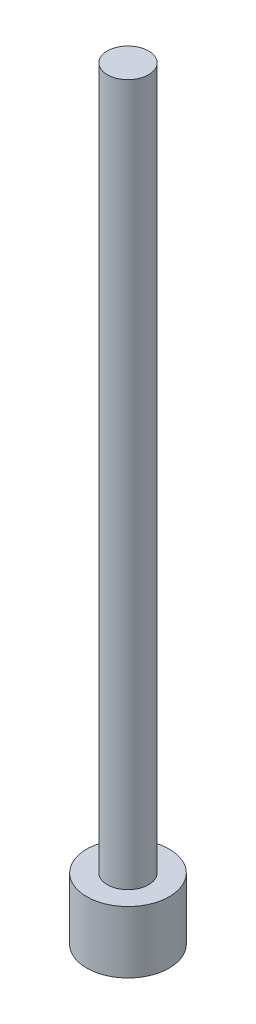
from build123d import *

# Parameters (mm, degrees)
ESQUISSE1_R      = 2
EXTRUSION1_DEPTH = 3
ESQUISSE2_R      = 1
EXTRUSION2_DEPTH = 34


with BuildPart() as part:
    # Esquisse1 → Extrusion1 (new body)
    with BuildSketch(Plane(origin=(0, 0, 0), x_dir=(1, 0, 0), z_dir=(0, 1, 0))):
        with Locations(Location((0, 0, 0), (0, 0, 270))):
            Circle(ESQUISSE1_R)
    extrude(amount=EXTRUSION1_DEPTH)

    # Esquisse2 → Extrusion2 (add)
    with BuildSketch(Plane(origin=(0, 3, 0), x_dir=(-1, 0, 0), z_dir=(0, 1, 0))):
        with Locations(Location((0, 0, 0), (0, 0, 90))):
            Circle(ESQUISSE2_R)
    extrude(amount=EXTRUSION2_DEPTH)


solid = part.part
